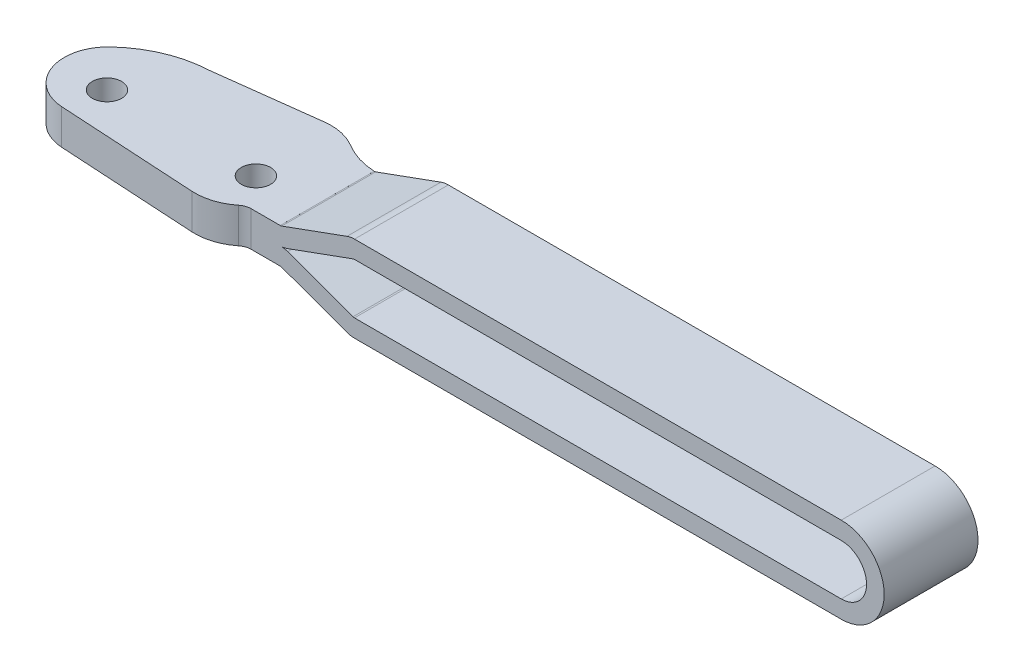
ISO-10303-21;
HEADER;
FILE_DESCRIPTION(('STEP AP214'),'2;1');
FILE_NAME('part.step','',(''),(''),'','','');
FILE_SCHEMA(('AUTOMOTIVE_DESIGN { 1 0 10303 214 1 1 1 1 }'));
ENDSEC;
DATA;
#1=APPLICATION_CONTEXT('core data for automotive mechanical design processes');
#2=APPLICATION_PROTOCOL_DEFINITION('international standard','automotive_design',2000,#1);
#3=PRODUCT_CONTEXT('',#1,'mechanical');
#4=PRODUCT('Part','Part','',(#3));
#5=PRODUCT_RELATED_PRODUCT_CATEGORY('part','',(#4));
#6=PRODUCT_DEFINITION_FORMATION('','',#4);
#7=PRODUCT_DEFINITION_CONTEXT('part definition',#1,'design');
#8=PRODUCT_DEFINITION('design','',#6,#7);
#9=PRODUCT_DEFINITION_SHAPE('','',#8);
#10=(LENGTH_UNIT() NAMED_UNIT(*) SI_UNIT(.MILLI.,.METRE.));
#11=(NAMED_UNIT(*) PLANE_ANGLE_UNIT() SI_UNIT($,.RADIAN.));
#12=(NAMED_UNIT(*) SI_UNIT($,.STERADIAN.) SOLID_ANGLE_UNIT());
#13=UNCERTAINTY_MEASURE_WITH_UNIT(LENGTH_MEASURE(1.E-05),#10,'distance_accuracy_value','');
#14=(GEOMETRIC_REPRESENTATION_CONTEXT(3) GLOBAL_UNCERTAINTY_ASSIGNED_CONTEXT((#13)) GLOBAL_UNIT_ASSIGNED_CONTEXT((#10,
#11,#12)) REPRESENTATION_CONTEXT('',''));
#15=CARTESIAN_POINT('',(0.,0.,0.));
#16=DIRECTION('',(0.,0.,1.));
#17=DIRECTION('',(1.,0.,0.));
#18=AXIS2_PLACEMENT_3D('',#15,#16,#17);
#19=CARTESIAN_POINT('',(47.2063680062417,4.2733725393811,-24.7492));
#20=DIRECTION('',(-0.342020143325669,0.939692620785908,0.));
#21=DIRECTION('',(-0.939692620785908,-0.342020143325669,0.));
#22=AXIS2_PLACEMENT_3D('',#19,#20,#21);
#23=PLANE('',#22);
#24=DIRECTION('',(0.939692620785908,0.342020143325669,0.));
#25=VECTOR('',#24,1.);
#26=CARTESIAN_POINT('',(47.2063680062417,4.27337253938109,5.25080000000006));
#27=LINE('',#26,#25);
#28=CARTESIAN_POINT('',(36.0795709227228,0.223549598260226,5.2508));
#29=VERTEX_POINT('',#28);
#30=CARTESIAN_POINT('',(47.2063680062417,4.2733725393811,5.25080000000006));
#31=VERTEX_POINT('',#30);
#32=EDGE_CURVE('E29',#29,#31,#27,.T.);
#33=ORIENTED_EDGE('',*,*,#32,.F.);
#34=DIRECTION('',(0.,0.,1.));
#35=VECTOR('',#34,1.);
#36=CARTESIAN_POINT('',(36.0795709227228,0.223549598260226,-24.7492));
#37=LINE('',#36,#35);
#38=CARTESIAN_POINT('',(36.0795709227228,0.223549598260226,-10.7512000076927));
#39=VERTEX_POINT('',#38);
#40=EDGE_CURVE('E523',#39,#29,#37,.T.);
#41=ORIENTED_EDGE('',*,*,#40,.F.);
#42=DIRECTION('',(-0.939692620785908,-0.342020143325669,0.));
#43=VECTOR('',#42,1.);
#44=CARTESIAN_POINT('',(47.2063680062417,4.27337253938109,-10.7512000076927));
#45=LINE('',#44,#43);
#46=CARTESIAN_POINT('',(47.2063680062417,4.2733725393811,-10.7512000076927));
#47=VERTEX_POINT('',#46);
#48=EDGE_CURVE('E510',#47,#39,#45,.T.);
#49=ORIENTED_EDGE('',*,*,#48,.F.);
#50=DIRECTION('',(0.,0.,1.));
#51=VECTOR('',#50,1.);
#52=CARTESIAN_POINT('',(47.2063680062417,4.2733725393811,-24.7492));
#53=LINE('',#52,#51);
#54=EDGE_CURVE('E519',#47,#31,#53,.T.);
#55=ORIENTED_EDGE('',*,*,#54,.T.);
#56=EDGE_LOOP('',(#33,#41,#49,#55));
#57=FACE_BOUND('',#56,.T.);
#58=ADVANCED_FACE('F14',(#57),#23,.F.);
#59=CARTESIAN_POINT('',(34.8004155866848,3.73799999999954,-24.7492));
#60=DIRECTION('',(0.,0.,1.));
#61=DIRECTION('',(-1.,0.,0.));
#62=AXIS2_PLACEMENT_3D('',#59,#60,#61);
#63=CYLINDRICAL_SURFACE('',#62,3.74);
#64=CARTESIAN_POINT('',(34.8004155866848,3.73799999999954,5.2508));
#65=DIRECTION('',(0.,0.,1.));
#66=DIRECTION('',(-1.,0.,0.));
#67=AXIS2_PLACEMENT_3D('',#64,#65,#66);
#68=CIRCLE('',#67,3.74);
#69=CARTESIAN_POINT('',(34.922710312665,-1.24032728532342E-13,5.2508));
#70=VERTEX_POINT('',#69);
#71=EDGE_CURVE('E36',#70,#29,#68,.T.);
#72=ORIENTED_EDGE('',*,*,#71,.F.);
#73=DIRECTION('',(0.,0.,1.));
#74=VECTOR('',#73,1.);
#75=CARTESIAN_POINT('',(34.922710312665,-1.24032728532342E-13,-24.7492));
#76=LINE('',#75,#74);
#77=CARTESIAN_POINT('',(34.922710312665,-1.24032728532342E-13,-10.766723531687));
#78=VERTEX_POINT('',#77);
#79=EDGE_CURVE('E525',#78,#70,#76,.T.);
#80=ORIENTED_EDGE('',*,*,#79,.F.);
#81=CARTESIAN_POINT('',(35.8850835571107,0.158740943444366,-10.7512000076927));
#82=CARTESIAN_POINT('',(35.7972347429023,0.132109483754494,-10.7526567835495));
#83=CARTESIAN_POINT('',(35.7084116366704,0.108731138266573,-10.7541134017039));
#84=CARTESIAN_POINT('',(35.5292871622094,0.0685659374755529,-10.7570266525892));
#85=CARTESIAN_POINT('',(35.4389857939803,0.0517790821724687,-10.7584832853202));
#86=CARTESIAN_POINT('',(35.2072776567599,0.0174625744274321,-10.7622006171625));
#87=CARTESIAN_POINT('',(35.0651614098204,0.0046326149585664,-10.7644615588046));
#88=CARTESIAN_POINT('',(34.922710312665,-1.34441069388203E-13,-10.766723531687));
#89=B_SPLINE_CURVE_WITH_KNOTS('',3,(#81,#82,#83,#84,#85,#86,#87,#88),.UNSPECIFIED.,.F.,.F.,(4,2,
2,4),(0.,0.275341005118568,0.550682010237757,0.977929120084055),.UNSPECIFIED.);
#90=CARTESIAN_POINT('',(35.8850835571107,0.158740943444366,-10.7512000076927));
#91=VERTEX_POINT('',#90);
#92=EDGE_CURVE('E9',#91,#78,#89,.T.);
#93=ORIENTED_EDGE('',*,*,#92,.F.);
#94=CARTESIAN_POINT('',(34.8004155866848,3.73799999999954,-10.7512000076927));
#95=DIRECTION('',(0.,0.,-1.));
#96=DIRECTION('',(1.,0.,0.));
#97=AXIS2_PLACEMENT_3D('',#94,#95,#96);
#98=CIRCLE('',#97,3.74);
#99=EDGE_CURVE('E584',#39,#91,#98,.T.);
#100=ORIENTED_EDGE('',*,*,#99,.F.);
#101=ORIENTED_EDGE('',*,*,#40,.T.);
#102=EDGE_LOOP('',(#72,#80,#93,#100,#101));
#103=FACE_BOUND('',#102,.T.);
#104=ADVANCED_FACE('F420',(#103),#63,.T.);
#105=CARTESIAN_POINT('',(34.8004155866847,-3.73799999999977,-24.7492));
#106=DIRECTION('',(0.,0.,1.));
#107=DIRECTION('',(-1.,0.,0.));
#108=AXIS2_PLACEMENT_3D('',#105,#106,#107);
#109=CYLINDRICAL_SURFACE('',#108,3.74);
#110=CARTESIAN_POINT('',(34.8004155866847,-3.73799999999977,5.2508));
#111=DIRECTION('',(0.,0.,1.));
#112=DIRECTION('',(-1.,0.,0.));
#113=AXIS2_PLACEMENT_3D('',#110,#111,#112);
#114=CIRCLE('',#113,3.74);
#115=CARTESIAN_POINT('',(36.0795709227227,-0.223549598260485,5.2508));
#116=VERTEX_POINT('',#115);
#117=EDGE_CURVE('E615',#116,#70,#114,.T.);
#118=ORIENTED_EDGE('',*,*,#117,.F.);
#119=DIRECTION('',(0.,0.,1.));
#120=VECTOR('',#119,1.);
#121=CARTESIAN_POINT('',(36.0795709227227,-0.223549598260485,-24.7492));
#122=LINE('',#121,#120);
#123=CARTESIAN_POINT('',(36.0795709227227,-0.223549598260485,-10.7512000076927));
#124=VERTEX_POINT('',#123);
#125=EDGE_CURVE('E644',#124,#116,#122,.T.);
#126=ORIENTED_EDGE('',*,*,#125,.F.);
#127=CARTESIAN_POINT('',(34.8004155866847,-3.73799999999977,-10.7512000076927));
#128=DIRECTION('',(0.,0.,-1.));
#129=DIRECTION('',(1.,0.,0.));
#130=AXIS2_PLACEMENT_3D('',#127,#128,#129);
#131=CIRCLE('',#130,3.74);
#132=CARTESIAN_POINT('',(35.8850835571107,-0.158740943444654,-10.7512000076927));
#133=VERTEX_POINT('',#132);
#134=EDGE_CURVE('E597',#133,#124,#131,.T.);
#135=ORIENTED_EDGE('',*,*,#134,.F.);
#136=CARTESIAN_POINT('',(34.922710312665,-1.24032728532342E-13,-10.766723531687));
#137=CARTESIAN_POINT('',(35.0144582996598,-0.00299256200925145,-10.7652666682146));
#138=CARTESIAN_POINT('',(35.1060842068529,-0.00937880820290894,-10.7638099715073));
#139=CARTESIAN_POINT('',(35.2886190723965,-0.0288683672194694,-10.7608966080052));
#140=CARTESIAN_POINT('',(35.379528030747,-0.0419716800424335,-10.7594399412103));
#141=CARTESIAN_POINT('',(35.6099826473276,-0.0838877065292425,-10.7557226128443));
#142=CARTESIAN_POINT('',(35.7486908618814,-0.117379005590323,-10.7534617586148));
#143=CARTESIAN_POINT('',(35.8850835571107,-0.158740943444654,-10.7512000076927));
#144=B_SPLINE_CURVE_WITH_KNOTS('',3,(#136,#137,#138,#139,#140,#141,#142,#143),.UNSPECIFIED.,.F.,
.F.,(4,2,2,4),(0.,0.275341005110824,0.550682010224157,0.977929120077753),.UNSPECIFIED.);
#145=EDGE_CURVE('E355',#78,#133,#144,.T.);
#146=ORIENTED_EDGE('',*,*,#145,.F.);
#147=ORIENTED_EDGE('',*,*,#79,.T.);
#148=EDGE_LOOP('',(#118,#126,#135,#146,#147));
#149=FACE_BOUND('',#148,.T.);
#150=ADVANCED_FACE('F424',(#149),#109,.T.);
#151=CARTESIAN_POINT('',(36.0795709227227,-0.223549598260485,-24.7492));
#152=DIRECTION('',(-0.342020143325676,-0.939692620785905,0.));
#153=DIRECTION('',(0.939692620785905,-0.342020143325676,0.));
#154=AXIS2_PLACEMENT_3D('',#151,#152,#153);
#155=PLANE('',#154);
#156=DIRECTION('',(-0.939692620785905,0.342020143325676,0.));
#157=VECTOR('',#156,1.);
#158=CARTESIAN_POINT('',(36.0795709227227,-0.223549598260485,5.2508));
#159=LINE('',#158,#157);
#160=CARTESIAN_POINT('',(47.2063680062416,-4.27337253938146,5.25080000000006));
#161=VERTEX_POINT('',#160);
#162=EDGE_CURVE('E617',#161,#116,#159,.T.);
#163=ORIENTED_EDGE('',*,*,#162,.F.);
#164=DIRECTION('',(0.,0.,1.));
#165=VECTOR('',#164,1.);
#166=CARTESIAN_POINT('',(47.2063680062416,-4.27337253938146,-24.7492));
#167=LINE('',#166,#165);
#168=CARTESIAN_POINT('',(47.2063680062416,-4.27337253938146,-10.7512000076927));
#169=VERTEX_POINT('',#168);
#170=EDGE_CURVE('E641',#169,#161,#167,.T.);
#171=ORIENTED_EDGE('',*,*,#170,.F.);
#172=DIRECTION('',(0.939692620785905,-0.342020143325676,0.));
#173=VECTOR('',#172,1.);
#174=CARTESIAN_POINT('',(36.0795709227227,-0.223549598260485,-10.7512000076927));
#175=LINE('',#174,#173);
#176=EDGE_CURVE('E595',#124,#169,#175,.T.);
#177=ORIENTED_EDGE('',*,*,#176,.F.);
#178=ORIENTED_EDGE('',*,*,#125,.T.);
#179=EDGE_LOOP('',(#163,#171,#177,#178));
#180=FACE_BOUND('',#179,.T.);
#181=ADVANCED_FACE('F429',(#180),#155,.F.);
#182=CARTESIAN_POINT('',(47.4594629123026,-3.57799999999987,-24.7492));
#183=DIRECTION('',(0.,0.,1.));
#184=DIRECTION('',(-1.,0.,0.));
#185=AXIS2_PLACEMENT_3D('',#182,#183,#184);
#186=CYLINDRICAL_SURFACE('',#185,0.740000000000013);
#187=CARTESIAN_POINT('',(47.4594629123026,-3.57799999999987,5.25080000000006));
#188=DIRECTION('',(0.,0.,1.));
#189=DIRECTION('',(-1.,0.,0.));
#190=AXIS2_PLACEMENT_3D('',#187,#188,#189);
#191=CIRCLE('',#190,0.740000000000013);
#192=CARTESIAN_POINT('',(47.4594629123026,-4.31799999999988,5.25080000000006));
#193=VERTEX_POINT('',#192);
#194=EDGE_CURVE('E619',#193,#161,#191,.F.);
#195=ORIENTED_EDGE('',*,*,#194,.F.);
#196=DIRECTION('',(0.,0.,1.));
#197=VECTOR('',#196,1.);
#198=CARTESIAN_POINT('',(47.4594629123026,-4.31799999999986,-24.7492));
#199=LINE('',#198,#197);
#200=CARTESIAN_POINT('',(47.4594629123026,-4.31799999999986,-10.7512000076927));
#201=VERTEX_POINT('',#200);
#202=EDGE_CURVE('E636',#201,#193,#199,.T.);
#203=ORIENTED_EDGE('',*,*,#202,.F.);
#204=CARTESIAN_POINT('',(47.4594629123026,-3.57799999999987,-10.7512000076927));
#205=DIRECTION('',(0.,0.,-1.));
#206=DIRECTION('',(1.,0.,0.));
#207=AXIS2_PLACEMENT_3D('',#204,#205,#206);
#208=CIRCLE('',#207,0.740000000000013);
#209=EDGE_CURVE('E593',#169,#201,#208,.F.);
#210=ORIENTED_EDGE('',*,*,#209,.F.);
#211=ORIENTED_EDGE('',*,*,#170,.T.);
#212=EDGE_LOOP('',(#195,#203,#210,#211));
#213=FACE_BOUND('',#212,.T.);
#214=ADVANCED_FACE('F433',(#213),#186,.F.);
#215=CARTESIAN_POINT('',(47.4594629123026,-4.31799999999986,-24.7492));
#216=DIRECTION('',(0.,-1.,0.));
#217=DIRECTION('',(1.,0.,0.));
#218=AXIS2_PLACEMENT_3D('',#215,#216,#217);
#219=PLANE('',#218);
#220=DIRECTION('',(-1.,0.,0.));
#221=VECTOR('',#220,1.);
#222=CARTESIAN_POINT('',(47.4594629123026,-4.31799999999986,5.25080000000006));
#223=LINE('',#222,#221);
#224=CARTESIAN_POINT('',(130.4574468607,-4.31800000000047,5.25080000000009));
#225=VERTEX_POINT('',#224);
#226=EDGE_CURVE('E621',#225,#193,#223,.T.);
#227=ORIENTED_EDGE('',*,*,#226,.F.);
#228=DIRECTION('',(0.,0.,1.));
#229=VECTOR('',#228,1.);
#230=CARTESIAN_POINT('',(130.4574468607,-4.31800000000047,-24.7492));
#231=LINE('',#230,#229);
#232=CARTESIAN_POINT('',(130.4574468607,-4.31800000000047,-10.7512000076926));
#233=VERTEX_POINT('',#232);
#234=EDGE_CURVE('E633',#233,#225,#231,.T.);
#235=ORIENTED_EDGE('',*,*,#234,.F.);
#236=DIRECTION('',(1.,0.,0.));
#237=VECTOR('',#236,1.);
#238=CARTESIAN_POINT('',(47.4594629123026,-4.31799999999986,-10.7512000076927));
#239=LINE('',#238,#237);
#240=EDGE_CURVE('E591',#201,#233,#239,.T.);
#241=ORIENTED_EDGE('',*,*,#240,.F.);
#242=ORIENTED_EDGE('',*,*,#202,.T.);
#243=EDGE_LOOP('',(#227,#235,#241,#242));
#244=FACE_BOUND('',#243,.T.);
#245=ADVANCED_FACE('F437',(#244),#219,.F.);
#246=CARTESIAN_POINT('',(130.4574468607,-4.64038529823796E-13,-24.7492));
#247=DIRECTION('',(0.,0.,1.));
#248=DIRECTION('',(-1.,0.,0.));
#249=AXIS2_PLACEMENT_3D('',#246,#247,#248);
#250=CYLINDRICAL_SURFACE('',#249,4.318);
#251=CARTESIAN_POINT('',(130.4574468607,-4.64038529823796E-13,5.25080000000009));
#252=DIRECTION('',(0.,0.,1.));
#253=DIRECTION('',(-1.,0.,0.));
#254=AXIS2_PLACEMENT_3D('',#251,#252,#253);
#255=CIRCLE('',#254,4.318);
#256=CARTESIAN_POINT('',(130.4574468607,4.31799999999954,5.25080000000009));
#257=VERTEX_POINT('',#256);
#258=EDGE_CURVE('E623',#257,#225,#255,.F.);
#259=ORIENTED_EDGE('',*,*,#258,.F.);
#260=DIRECTION('',(0.,0.,1.));
#261=VECTOR('',#260,1.);
#262=CARTESIAN_POINT('',(130.4574468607,4.31799999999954,-24.7492));
#263=LINE('',#262,#261);
#264=CARTESIAN_POINT('',(130.4574468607,4.31799999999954,-10.7512000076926));
#265=VERTEX_POINT('',#264);
#266=EDGE_CURVE('E631',#265,#257,#263,.T.);
#267=ORIENTED_EDGE('',*,*,#266,.F.);
#268=CARTESIAN_POINT('',(130.4574468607,-4.64038529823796E-13,-10.7512000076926));
#269=DIRECTION('',(0.,0.,-1.));
#270=DIRECTION('',(1.,0.,0.));
#271=AXIS2_PLACEMENT_3D('',#268,#269,#270);
#272=CIRCLE('',#271,4.318);
#273=EDGE_CURVE('E589',#233,#265,#272,.F.);
#274=ORIENTED_EDGE('',*,*,#273,.F.);
#275=ORIENTED_EDGE('',*,*,#234,.T.);
#276=EDGE_LOOP('',(#259,#267,#274,#275));
#277=FACE_BOUND('',#276,.T.);
#278=ADVANCED_FACE('F441',(#277),#250,.F.);
#279=CARTESIAN_POINT('',(130.4574468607,4.31799999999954,-24.7492));
#280=DIRECTION('',(0.,1.,0.));
#281=DIRECTION('',(0.,0.,1.));
#282=AXIS2_PLACEMENT_3D('',#279,#280,#281);
#283=PLANE('',#282);
#284=DIRECTION('',(1.,0.,0.));
#285=VECTOR('',#284,1.);
#286=CARTESIAN_POINT('',(130.4574468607,4.31799999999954,5.25080000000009));
#287=LINE('',#286,#285);
#288=CARTESIAN_POINT('',(47.4594629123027,4.31799999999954,5.25080000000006));
#289=VERTEX_POINT('',#288);
#290=EDGE_CURVE('E521',#289,#257,#287,.T.);
#291=ORIENTED_EDGE('',*,*,#290,.F.);
#292=DIRECTION('',(0.,0.,1.));
#293=VECTOR('',#292,1.);
#294=CARTESIAN_POINT('',(47.4594629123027,4.31799999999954,-24.7492));
#295=LINE('',#294,#293);
#296=CARTESIAN_POINT('',(47.4594629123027,4.31799999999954,-10.7512000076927));
#297=VERTEX_POINT('',#296);
#298=EDGE_CURVE('E506',#297,#289,#295,.T.);
#299=ORIENTED_EDGE('',*,*,#298,.F.);
#300=DIRECTION('',(-1.,0.,0.));
#301=VECTOR('',#300,1.);
#302=CARTESIAN_POINT('',(130.4574468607,4.31799999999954,-10.7512000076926));
#303=LINE('',#302,#301);
#304=EDGE_CURVE('E587',#265,#297,#303,.T.);
#305=ORIENTED_EDGE('',*,*,#304,.F.);
#306=ORIENTED_EDGE('',*,*,#266,.T.);
#307=EDGE_LOOP('',(#291,#299,#305,#306));
#308=FACE_BOUND('',#307,.T.);
#309=ADVANCED_FACE('F417',(#308),#283,.F.);
#310=CARTESIAN_POINT('',(47.4594629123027,3.57799999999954,-24.7492));
#311=DIRECTION('',(0.,0.,1.));
#312=DIRECTION('',(-1.,0.,0.));
#313=AXIS2_PLACEMENT_3D('',#310,#311,#312);
#314=CYLINDRICAL_SURFACE('',#313,0.74);
#315=CARTESIAN_POINT('',(47.4594629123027,3.57799999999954,5.25080000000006));
#316=DIRECTION('',(0.,0.,1.));
#317=DIRECTION('',(-1.,0.,0.));
#318=AXIS2_PLACEMENT_3D('',#315,#316,#317);
#319=CIRCLE('',#318,0.74);
#320=EDGE_CURVE('E492',#31,#289,#319,.F.);
#321=ORIENTED_EDGE('',*,*,#320,.F.);
#322=ORIENTED_EDGE('',*,*,#54,.F.);
#323=CARTESIAN_POINT('',(47.4594629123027,3.57799999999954,-10.7512000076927));
#324=DIRECTION('',(0.,0.,-1.));
#325=DIRECTION('',(1.,0.,0.));
#326=AXIS2_PLACEMENT_3D('',#323,#324,#325);
#327=CIRCLE('',#326,0.74);
#328=EDGE_CURVE('E44',#297,#47,#327,.F.);
#329=ORIENTED_EDGE('',*,*,#328,.F.);
#330=ORIENTED_EDGE('',*,*,#298,.T.);
#331=EDGE_LOOP('',(#321,#322,#329,#330));
#332=FACE_BOUND('',#331,.T.);
#333=ADVANCED_FACE('F334',(#332),#314,.F.);
#334=CARTESIAN_POINT('',(34.8004155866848,32.0019999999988,-10.7686647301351));
#335=CARTESIAN_POINT('',(35.1672420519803,32.0019999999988,-10.7628431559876));
#336=CARTESIAN_POINT('',(35.5340228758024,32.0019999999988,-10.7570215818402));
#337=CARTESIAN_POINT('',(35.8850835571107,32.0019999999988,-10.7512000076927));
#338=B_SPLINE_CURVE_WITH_KNOTS('',3,(#334,#335,#336,#337),.UNSPECIFIED.,.F.,.F.,(4,4),(0.,1.),.UNSPECIFIED.);
#339=DIRECTION('',(0.,-1.,0.));
#340=VECTOR('',#339,1.);
#341=SURFACE_OF_LINEAR_EXTRUSION('',#338,#340);
#342=CARTESIAN_POINT('',(35.8850835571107,3.34529530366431,-10.7512000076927));
#343=CARTESIAN_POINT('',(35.7464887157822,3.29485090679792,-10.7534871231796));
#344=CARTESIAN_POINT('',(35.6078935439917,3.2444063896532,-10.7557510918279));
#345=CARTESIAN_POINT('',(35.3307025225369,3.14351710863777,-10.7602327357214));
#346=CARTESIAN_POINT('',(35.1921066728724,3.09307234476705,-10.7624504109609));
#347=CARTESIAN_POINT('',(35.0535104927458,3.04262746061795,-10.7646449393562));
#348=B_SPLINE_CURVE_WITH_KNOTS('',3,(#342,#343,#344,#345,#346,#347),.UNSPECIFIED.,.F.,.F.,(4,2,
4),(0.,0.442521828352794,0.885043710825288),.UNSPECIFIED.);
#349=CARTESIAN_POINT('',(35.8850835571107,3.34529530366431,-10.7512000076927));
#350=VERTEX_POINT('',#349);
#351=CARTESIAN_POINT('',(35.0535104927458,3.04262746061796,-10.7646449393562));
#352=VERTEX_POINT('',#351);
#353=EDGE_CURVE('E375',#350,#352,#348,.T.);
#354=ORIENTED_EDGE('',*,*,#353,.F.);
#355=DIRECTION('',(0.,-1.,0.));
#356=VECTOR('',#355,1.);
#357=CARTESIAN_POINT('',(35.8850835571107,32.0019999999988,-10.7512000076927));
#358=LINE('',#357,#356);
#359=EDGE_CURVE('E234',#350,#91,#358,.T.);
#360=ORIENTED_EDGE('',*,*,#359,.T.);
#361=ORIENTED_EDGE('',*,*,#92,.T.);
#362=ORIENTED_EDGE('',*,*,#145,.T.);
#363=CARTESIAN_POINT('',(35.8850835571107,-3.34529530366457,-10.7512000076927));
#364=VERTEX_POINT('',#363);
#365=EDGE_CURVE('E573',#133,#364,#358,.T.);
#366=ORIENTED_EDGE('',*,*,#365,.T.);
#367=CARTESIAN_POINT('',(35.0535104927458,-3.0426274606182,-10.7646449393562));
#368=CARTESIAN_POINT('',(35.1921066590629,-3.09307233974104,-10.7624504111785));
#369=CARTESIAN_POINT('',(35.3307024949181,-3.14351709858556,-10.7602327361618));
#370=CARTESIAN_POINT('',(35.6078935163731,-3.24440637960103,-10.7557510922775));
#371=CARTESIAN_POINT('',(35.7464887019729,-3.29485090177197,-10.7534871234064));
#372=CARTESIAN_POINT('',(35.8850835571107,-3.34529530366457,-10.7512000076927));
#373=B_SPLINE_CURVE_WITH_KNOTS('',3,(#367,#368,#369,#370,#371,#372),.UNSPECIFIED.,.F.,.F.,(4,2,
4),(0.,0.442521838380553,0.885043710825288),.UNSPECIFIED.);
#374=CARTESIAN_POINT('',(35.0535104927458,-3.04262746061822,-10.7646449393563));
#375=VERTEX_POINT('',#374);
#376=EDGE_CURVE('E369',#375,#364,#373,.T.);
#377=ORIENTED_EDGE('',*,*,#376,.F.);
#378=CARTESIAN_POINT('',(34.8004155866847,-2.99799999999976,-10.7686647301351));
#379=CARTESIAN_POINT('',(34.8148467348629,-2.99799948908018,-10.7684357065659));
#380=CARTESIAN_POINT('',(34.829277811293,-2.99842212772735,-10.7682066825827));
#381=CARTESIAN_POINT('',(34.8579939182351,-3.00010433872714,-10.767750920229));
#382=CARTESIAN_POINT('',(34.8722792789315,-3.00135827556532,-10.7675241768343));
#383=CARTESIAN_POINT('',(34.9007050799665,-3.00468822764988,-10.767072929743));
#384=CARTESIAN_POINT('',(34.9148458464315,-3.00676145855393,-10.7668484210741));
#385=CARTESIAN_POINT('',(34.9429837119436,-3.01172290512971,-10.7664015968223));
#386=CARTESIAN_POINT('',(34.9569808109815,-3.0146111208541,-10.7661792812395));
#387=CARTESIAN_POINT('',(34.9848313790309,-3.02120418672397,-10.7657368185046));
#388=CARTESIAN_POINT('',(34.9986842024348,-3.02491176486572,-10.7655166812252));
#389=CARTESIAN_POINT('',(35.026244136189,-3.03315255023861,-10.7650785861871));
#390=CARTESIAN_POINT('',(35.0399496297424,-3.03769116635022,-10.7648606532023));
#391=CARTESIAN_POINT('',(35.0535104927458,-3.04262746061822,-10.7646449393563));
#392=B_SPLINE_CURVE_WITH_KNOTS('',3,(#378,#379,#380,#381,#382,#383,#384,#385,#386,#387,#388,
#389,#390,#391),.UNSPECIFIED.,.F.,.F.,(4,2,2,2,2,2,4),(0.,0.0432925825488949,0.0862946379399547,
0.129151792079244,0.172008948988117,0.215011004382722,0.258303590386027),.UNSPECIFIED.);
#393=CARTESIAN_POINT('',(34.8004155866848,-2.99799999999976,-10.7686647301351));
#394=VERTEX_POINT('',#393);
#395=EDGE_CURVE('E363',#394,#375,#392,.T.);
#396=ORIENTED_EDGE('',*,*,#395,.F.);
#397=DIRECTION('',(0.,-1.,0.));
#398=VECTOR('',#397,1.);
#399=CARTESIAN_POINT('',(34.8004155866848,32.0019999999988,-10.7686647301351));
#400=LINE('',#399,#398);
#401=CARTESIAN_POINT('',(34.8004155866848,2.99799999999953,-10.7686647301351));
#402=VERTEX_POINT('',#401);
#403=EDGE_CURVE('E469',#402,#394,#400,.T.);
#404=ORIENTED_EDGE('',*,*,#403,.F.);
#405=CARTESIAN_POINT('',(35.0535104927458,3.04262746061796,-10.7646449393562));
#406=CARTESIAN_POINT('',(35.0399496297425,3.03769116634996,-10.7648606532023));
#407=CARTESIAN_POINT('',(35.026244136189,3.03315255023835,-10.7650785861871));
#408=CARTESIAN_POINT('',(34.9986842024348,3.02491176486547,-10.7655166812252));
#409=CARTESIAN_POINT('',(34.9848313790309,3.02120418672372,-10.7657368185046));
#410=CARTESIAN_POINT('',(34.9569808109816,3.01461112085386,-10.7661792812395));
#411=CARTESIAN_POINT('',(34.9429837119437,3.01172290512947,-10.7664015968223));
#412=CARTESIAN_POINT('',(34.9148458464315,3.00676145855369,-10.7668484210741));
#413=CARTESIAN_POINT('',(34.9007050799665,3.00468822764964,-10.767072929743));
#414=CARTESIAN_POINT('',(34.8722792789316,3.00135827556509,-10.7675241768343));
#415=CARTESIAN_POINT('',(34.8579939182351,3.00010433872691,-10.767750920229));
#416=CARTESIAN_POINT('',(34.8292778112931,2.99842212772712,-10.7682066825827));
#417=CARTESIAN_POINT('',(34.814846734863,2.99799948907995,-10.7684357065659));
#418=CARTESIAN_POINT('',(34.8004155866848,2.99799999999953,-10.7686647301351));
#419=B_SPLINE_CURVE_WITH_KNOTS('',3,(#405,#406,#407,#408,#409,#410,#411,#412,#413,#414,#415,
#416,#417,#418),.UNSPECIFIED.,.F.,.F.,(4,2,2,2,2,2,4),(0.,0.0432925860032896,0.0862946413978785,
0.12915179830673,0.172008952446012,0.21501100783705,0.258303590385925),.UNSPECIFIED.);
#420=EDGE_CURVE('E343',#352,#402,#419,.T.);
#421=ORIENTED_EDGE('',*,*,#420,.F.);
#422=EDGE_LOOP('',(#354,#360,#361,#362,#366,#377,#396,#404,#421));
#423=FACE_BOUND('',#422,.T.);
#424=ADVANCED_FACE('F329',(#423),#341,.T.);
#425=CARTESIAN_POINT('',(137.7754468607,32.0019999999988,5.25080000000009));
#426=DIRECTION('',(0.,0.,1.));
#427=DIRECTION('',(-1.,0.,0.));
#428=AXIS2_PLACEMENT_3D('',#425,#426,#427);
#429=PLANE('',#428);
#430=DIRECTION('',(0.,-1.,0.));
#431=VECTOR('',#430,1.);
#432=CARTESIAN_POINT('',(29.8413398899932,32.0019999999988,5.2508));
#433=LINE('',#432,#431);
#434=CARTESIAN_POINT('',(29.8413398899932,2.99999999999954,5.2508));
#435=VERTEX_POINT('',#434);
#436=CARTESIAN_POINT('',(29.8413398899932,-2.99999999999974,5.2508));
#437=VERTEX_POINT('',#436);
#438=EDGE_CURVE('E223',#435,#437,#433,.T.);
#439=ORIENTED_EDGE('',*,*,#438,.T.);
#440=DIRECTION('',(-1.,0.,0.));
#441=VECTOR('',#440,1.);
#442=CARTESIAN_POINT('',(34.8004155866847,-2.99999999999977,5.2508));
#443=LINE('',#442,#441);
#444=CARTESIAN_POINT('',(34.8004155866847,-2.99999999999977,5.2508));
#445=VERTEX_POINT('',#444);
#446=EDGE_CURVE('E292',#445,#437,#443,.T.);
#447=ORIENTED_EDGE('',*,*,#446,.F.);
#448=DIRECTION('',(0.,1.,0.));
#449=VECTOR('',#448,1.);
#450=CARTESIAN_POINT('',(34.8004155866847,-2.99999999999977,5.2508));
#451=LINE('',#450,#449);
#452=CARTESIAN_POINT('',(34.8004155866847,-2.99799999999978,5.2508));
#453=VERTEX_POINT('',#452);
#454=EDGE_CURVE('E313',#445,#453,#451,.T.);
#455=ORIENTED_EDGE('',*,*,#454,.T.);
#456=CARTESIAN_POINT('',(34.8004155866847,-3.73799999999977,5.2508));
#457=DIRECTION('',(0.,0.,1.));
#458=DIRECTION('',(-1.,0.,0.));
#459=AXIS2_PLACEMENT_3D('',#456,#457,#458);
#460=CIRCLE('',#459,0.74);
#461=CARTESIAN_POINT('',(35.0535104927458,-3.04262746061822,5.2508));
#462=VERTEX_POINT('',#461);
#463=EDGE_CURVE('E486',#462,#453,#460,.T.);
#464=ORIENTED_EDGE('',*,*,#463,.F.);
#465=DIRECTION('',(-0.939692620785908,0.342020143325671,0.));
#466=VECTOR('',#465,1.);
#467=CARTESIAN_POINT('',(35.0535104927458,-3.0426274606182,5.2508));
#468=LINE('',#467,#466);
#469=CARTESIAN_POINT('',(46.1803075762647,-7.09245040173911,5.25080000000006));
#470=VERTEX_POINT('',#469);
#471=EDGE_CURVE('E488',#470,#462,#468,.T.);
#472=ORIENTED_EDGE('',*,*,#471,.F.);
#473=CARTESIAN_POINT('',(47.4594629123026,-3.57799999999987,5.25080000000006));
#474=DIRECTION('',(0.,0.,1.));
#475=DIRECTION('',(-1.,0.,0.));
#476=AXIS2_PLACEMENT_3D('',#473,#474,#475);
#477=CIRCLE('',#476,3.73999999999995);
#478=CARTESIAN_POINT('',(47.4594629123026,-7.31799999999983,5.25080000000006));
#479=VERTEX_POINT('',#478);
#480=EDGE_CURVE('E500',#479,#470,#477,.F.);
#481=ORIENTED_EDGE('',*,*,#480,.F.);
#482=DIRECTION('',(-1.,0.,0.));
#483=VECTOR('',#482,1.);
#484=CARTESIAN_POINT('',(47.4594629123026,-7.31799999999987,5.25080000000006));
#485=LINE('',#484,#483);
#486=CARTESIAN_POINT('',(130.4574468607,-7.31800000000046,5.25080000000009));
#487=VERTEX_POINT('',#486);
#488=EDGE_CURVE('E555',#487,#479,#485,.T.);
#489=ORIENTED_EDGE('',*,*,#488,.F.);
#490=CARTESIAN_POINT('',(130.4574468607,-4.64038529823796E-13,5.25080000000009));
#491=DIRECTION('',(0.,0.,1.));
#492=DIRECTION('',(-1.,0.,0.));
#493=AXIS2_PLACEMENT_3D('',#490,#491,#492);
#494=CIRCLE('',#493,7.318);
#495=CARTESIAN_POINT('',(130.4574468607,7.31799999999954,5.25080000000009));
#496=VERTEX_POINT('',#495);
#497=EDGE_CURVE('E556',#496,#487,#494,.F.);
#498=ORIENTED_EDGE('',*,*,#497,.F.);
#499=DIRECTION('',(1.,0.,0.));
#500=VECTOR('',#499,1.);
#501=CARTESIAN_POINT('',(130.4574468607,7.31799999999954,5.25080000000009));
#502=LINE('',#501,#500);
#503=CARTESIAN_POINT('',(47.4594629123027,7.31799999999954,5.25080000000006));
#504=VERTEX_POINT('',#503);
#505=EDGE_CURVE('E558',#504,#496,#502,.T.);
#506=ORIENTED_EDGE('',*,*,#505,.F.);
#507=CARTESIAN_POINT('',(47.4594629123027,3.57799999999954,5.25080000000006));
#508=DIRECTION('',(0.,0.,1.));
#509=DIRECTION('',(-1.,0.,0.));
#510=AXIS2_PLACEMENT_3D('',#507,#508,#509);
#511=CIRCLE('',#510,3.74);
#512=CARTESIAN_POINT('',(46.1803075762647,7.09245040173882,5.25080000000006));
#513=VERTEX_POINT('',#512);
#514=EDGE_CURVE('E564',#513,#504,#511,.F.);
#515=ORIENTED_EDGE('',*,*,#514,.F.);
#516=DIRECTION('',(0.939692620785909,0.342020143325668,0.));
#517=VECTOR('',#516,1.);
#518=CARTESIAN_POINT('',(46.1803075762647,7.09245040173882,5.2508));
#519=LINE('',#518,#517);
#520=CARTESIAN_POINT('',(35.0535104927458,3.04262746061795,5.2508));
#521=VERTEX_POINT('',#520);
#522=EDGE_CURVE('E567',#521,#513,#519,.T.);
#523=ORIENTED_EDGE('',*,*,#522,.F.);
#524=CARTESIAN_POINT('',(34.8004155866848,3.73799999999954,5.2508));
#525=DIRECTION('',(0.,0.,1.));
#526=DIRECTION('',(-1.,0.,0.));
#527=AXIS2_PLACEMENT_3D('',#524,#525,#526);
#528=CIRCLE('',#527,0.74);
#529=CARTESIAN_POINT('',(34.8004155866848,2.99799999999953,5.2508));
#530=VERTEX_POINT('',#529);
#531=EDGE_CURVE('E570',#530,#521,#528,.T.);
#532=ORIENTED_EDGE('',*,*,#531,.F.);
#533=DIRECTION('',(0.,-1.,0.));
#534=VECTOR('',#533,1.);
#535=CARTESIAN_POINT('',(34.8004155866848,2.99999999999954,5.2508));
#536=LINE('',#535,#534);
#537=CARTESIAN_POINT('',(34.8004155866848,2.99999999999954,5.2508));
#538=VERTEX_POINT('',#537);
#539=EDGE_CURVE('E240',#538,#530,#536,.T.);
#540=ORIENTED_EDGE('',*,*,#539,.F.);
#541=DIRECTION('',(1.,0.,0.));
#542=VECTOR('',#541,1.);
#543=CARTESIAN_POINT('',(29.8413398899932,2.99999999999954,5.2508));
#544=LINE('',#543,#542);
#545=EDGE_CURVE('E237',#435,#538,#544,.T.);
#546=ORIENTED_EDGE('',*,*,#545,.F.);
#547=EDGE_LOOP('',(#439,#447,#455,#464,#472,#481,#489,#498,#506,#515,#523,#532,#540,#546));
#548=FACE_BOUND('',#547,.T.);
#549=ORIENTED_EDGE('',*,*,#320,.T.);
#550=ORIENTED_EDGE('',*,*,#290,.T.);
#551=ORIENTED_EDGE('',*,*,#258,.T.);
#552=ORIENTED_EDGE('',*,*,#226,.T.);
#553=ORIENTED_EDGE('',*,*,#194,.T.);
#554=ORIENTED_EDGE('',*,*,#162,.T.);
#555=ORIENTED_EDGE('',*,*,#117,.T.);
#556=ORIENTED_EDGE('',*,*,#71,.T.);
#557=ORIENTED_EDGE('',*,*,#32,.T.);
#558=EDGE_LOOP('',(#549,#550,#551,#552,#553,#554,#555,#556,#557));
#559=FACE_BOUND('',#558,.T.);
#560=ADVANCED_FACE('F238',(#548,#559),#429,.T.);
#561=CARTESIAN_POINT('',(137.7754468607,32.0019999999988,-10.7512000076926));
#562=DIRECTION('',(0.,0.,-1.));
#563=DIRECTION('',(1.,0.,0.));
#564=AXIS2_PLACEMENT_3D('',#561,#562,#563);
#565=PLANE('',#564);
#566=CARTESIAN_POINT('',(47.4594629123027,3.57799999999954,-10.7512000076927));
#567=DIRECTION('',(0.,0.,-1.));
#568=DIRECTION('',(1.,0.,0.));
#569=AXIS2_PLACEMENT_3D('',#566,#567,#568);
#570=CIRCLE('',#569,3.74);
#571=CARTESIAN_POINT('',(47.4594629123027,7.31799999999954,-10.7512000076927));
#572=VERTEX_POINT('',#571);
#573=CARTESIAN_POINT('',(46.1803075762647,7.09245040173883,-10.7512000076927));
#574=VERTEX_POINT('',#573);
#575=EDGE_CURVE('E608',#572,#574,#570,.F.);
#576=ORIENTED_EDGE('',*,*,#575,.F.);
#577=DIRECTION('',(-1.,0.,0.));
#578=VECTOR('',#577,1.);
#579=CARTESIAN_POINT('',(130.4574468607,7.31799999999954,-10.7512000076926));
#580=LINE('',#579,#578);
#581=CARTESIAN_POINT('',(130.4574468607,7.31799999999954,-10.7512000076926));
#582=VERTEX_POINT('',#581);
#583=EDGE_CURVE('E605',#582,#572,#580,.T.);
#584=ORIENTED_EDGE('',*,*,#583,.F.);
#585=CARTESIAN_POINT('',(130.4574468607,-4.64038529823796E-13,-10.7512000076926));
#586=DIRECTION('',(0.,0.,-1.));
#587=DIRECTION('',(1.,0.,0.));
#588=AXIS2_PLACEMENT_3D('',#585,#586,#587);
#589=CIRCLE('',#588,7.318);
#590=CARTESIAN_POINT('',(130.4574468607,-7.31800000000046,-10.7512000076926));
#591=VERTEX_POINT('',#590);
#592=EDGE_CURVE('E603',#591,#582,#589,.F.);
#593=ORIENTED_EDGE('',*,*,#592,.F.);
#594=DIRECTION('',(1.,0.,0.));
#595=VECTOR('',#594,1.);
#596=CARTESIAN_POINT('',(47.4594629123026,-7.31799999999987,-10.7512000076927));
#597=LINE('',#596,#595);
#598=CARTESIAN_POINT('',(47.4594629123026,-7.31799999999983,-10.7512000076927));
#599=VERTEX_POINT('',#598);
#600=EDGE_CURVE('E552',#599,#591,#597,.T.);
#601=ORIENTED_EDGE('',*,*,#600,.F.);
#602=CARTESIAN_POINT('',(47.4594629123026,-3.57799999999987,-10.7512000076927));
#603=DIRECTION('',(0.,0.,-1.));
#604=DIRECTION('',(1.,0.,0.));
#605=AXIS2_PLACEMENT_3D('',#602,#603,#604);
#606=CIRCLE('',#605,3.73999999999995);
#607=CARTESIAN_POINT('',(46.1803075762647,-7.09245040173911,-10.7512000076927));
#608=VERTEX_POINT('',#607);
#609=EDGE_CURVE('E549',#608,#599,#606,.F.);
#610=ORIENTED_EDGE('',*,*,#609,.F.);
#611=DIRECTION('',(0.939692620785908,-0.342020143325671,0.));
#612=VECTOR('',#611,1.);
#613=CARTESIAN_POINT('',(35.0535104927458,-3.0426274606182,-10.7512000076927));
#614=LINE('',#613,#612);
#615=EDGE_CURVE('E599',#364,#608,#614,.T.);
#616=ORIENTED_EDGE('',*,*,#615,.F.);
#617=ORIENTED_EDGE('',*,*,#365,.F.);
#618=ORIENTED_EDGE('',*,*,#134,.T.);
#619=ORIENTED_EDGE('',*,*,#176,.T.);
#620=ORIENTED_EDGE('',*,*,#209,.T.);
#621=ORIENTED_EDGE('',*,*,#240,.T.);
#622=ORIENTED_EDGE('',*,*,#273,.T.);
#623=ORIENTED_EDGE('',*,*,#304,.T.);
#624=ORIENTED_EDGE('',*,*,#328,.T.);
#625=ORIENTED_EDGE('',*,*,#48,.T.);
#626=ORIENTED_EDGE('',*,*,#99,.T.);
#627=ORIENTED_EDGE('',*,*,#359,.F.);
#628=DIRECTION('',(-0.939692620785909,-0.342020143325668,0.));
#629=VECTOR('',#628,1.);
#630=CARTESIAN_POINT('',(46.1803075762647,7.09245040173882,-10.7512000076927));
#631=LINE('',#630,#629);
#632=EDGE_CURVE('E611',#574,#350,#631,.T.);
#633=ORIENTED_EDGE('',*,*,#632,.F.);
#634=EDGE_LOOP('',(#576,#584,#593,#601,#610,#616,#617,#618,#619,#620,#621,#622,#623,#624,#625,
#626,#627,#633));
#635=FACE_BOUND('',#634,.T.);
#636=ADVANCED_FACE('F336',(#635),#565,.T.);
#637=CARTESIAN_POINT('',(6.61093572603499,32.0019999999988,6.92432278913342));
#638=DIRECTION('',(0.,-1.,0.));
#639=DIRECTION('',(1.,0.,0.));
#640=AXIS2_PLACEMENT_3D('',#637,#638,#639);
#641=CYLINDRICAL_SURFACE('',#640,18.5549228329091);
#642=DIRECTION('',(0.,-1.,0.));
#643=VECTOR('',#642,1.);
#644=CARTESIAN_POINT('',(5.8376980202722,32.0019999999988,-11.6144815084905));
#645=LINE('',#644,#643);
#646=CARTESIAN_POINT('',(5.8376980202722,2.99999999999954,-11.6144815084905));
#647=VERTEX_POINT('',#646);
#648=CARTESIAN_POINT('',(5.8376980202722,-2.99999999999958,-11.6144815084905));
#649=VERTEX_POINT('',#648);
#650=EDGE_CURVE('E319',#647,#649,#645,.T.);
#651=ORIENTED_EDGE('',*,*,#650,.T.);
#652=CARTESIAN_POINT('',(6.61093572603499,-2.99999999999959,6.92432278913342));
#653=DIRECTION('',(0.,-1.,0.));
#654=DIRECTION('',(1.,0.,0.));
#655=AXIS2_PLACEMENT_3D('',#652,#653,#654);
#656=CIRCLE('',#655,18.5549228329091);
#657=CARTESIAN_POINT('',(-6.06278726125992,-2.9999999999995,-6.62786917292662));
#658=VERTEX_POINT('',#657);
#659=EDGE_CURVE('E304',#658,#649,#656,.T.);
#660=ORIENTED_EDGE('',*,*,#659,.F.);
#661=DIRECTION('',(0.,-1.,0.));
#662=VECTOR('',#661,1.);
#663=CARTESIAN_POINT('',(-6.0627872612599,32.0019999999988,-6.62786917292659));
#664=LINE('',#663,#662);
#665=CARTESIAN_POINT('',(-6.06278726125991,2.99999999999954,-6.62786917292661));
#666=VERTEX_POINT('',#665);
#667=EDGE_CURVE('E324',#666,#658,#664,.T.);
#668=ORIENTED_EDGE('',*,*,#667,.F.);
#669=CARTESIAN_POINT('',(6.61093572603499,2.99999999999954,6.92432278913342));
#670=DIRECTION('',(0.,1.,0.));
#671=DIRECTION('',(0.,0.,1.));
#672=AXIS2_PLACEMENT_3D('',#669,#670,#671);
#673=CIRCLE('',#672,18.5549228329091);
#674=EDGE_CURVE('E268',#647,#666,#673,.T.);
#675=ORIENTED_EDGE('',*,*,#674,.F.);
#676=EDGE_LOOP('',(#651,#660,#668,#675));
#677=FACE_BOUND('',#676,.T.);
#678=ADVANCED_FACE('F449',(#677),#641,.T.);
#679=CARTESIAN_POINT('',(-0.9399999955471,32.0019999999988,-1.15000000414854));
#680=DIRECTION('',(0.,-1.,0.));
#681=DIRECTION('',(1.,0.,0.));
#682=AXIS2_PLACEMENT_3D('',#679,#680,#681);
#683=CYLINDRICAL_SURFACE('',#682,7.49999999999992);
#684=ORIENTED_EDGE('',*,*,#667,.T.);
#685=CARTESIAN_POINT('',(-0.9399999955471,-2.99999999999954,-1.15000000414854));
#686=DIRECTION('',(0.,-1.,0.));
#687=DIRECTION('',(1.,0.,0.));
#688=AXIS2_PLACEMENT_3D('',#685,#686,#687);
#689=CIRCLE('',#688,7.5);
#690=CARTESIAN_POINT('',(-1.38060858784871,-2.99999999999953,6.33704641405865));
#691=VERTEX_POINT('',#690);
#692=EDGE_CURVE('E301',#691,#658,#689,.T.);
#693=ORIENTED_EDGE('',*,*,#692,.F.);
#694=DIRECTION('',(0.,-1.,0.));
#695=VECTOR('',#694,1.);
#696=CARTESIAN_POINT('',(-1.38060858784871,32.0019999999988,6.33704641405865));
#697=LINE('',#696,#695);
#698=CARTESIAN_POINT('',(-1.38060858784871,2.99999999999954,6.33704641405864));
#699=VERTEX_POINT('',#698);
#700=EDGE_CURVE('E679',#699,#691,#697,.T.);
#701=ORIENTED_EDGE('',*,*,#700,.F.);
#702=CARTESIAN_POINT('',(-0.9399999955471,2.99999999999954,-1.15000000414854));
#703=DIRECTION('',(0.,1.,0.));
#704=DIRECTION('',(0.,0.,1.));
#705=AXIS2_PLACEMENT_3D('',#702,#703,#704);
#706=CIRCLE('',#705,7.5);
#707=EDGE_CURVE('E271',#666,#699,#706,.T.);
#708=ORIENTED_EDGE('',*,*,#707,.F.);
#709=EDGE_LOOP('',(#684,#693,#701,#708));
#710=FACE_BOUND('',#709,.T.);
#711=ADVANCED_FACE('F452',(#710),#683,.T.);
#712=CARTESIAN_POINT('',(-1.38060858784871,32.0019999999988,6.33704641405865));
#713=DIRECTION('',(-0.0587478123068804,0.,0.998272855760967));
#714=DIRECTION('',(-0.998272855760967,0.,-0.0587478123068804));
#715=AXIS2_PLACEMENT_3D('',#712,#713,#714);
#716=PLANE('',#715);
#717=ORIENTED_EDGE('',*,*,#700,.T.);
#718=DIRECTION('',(-0.998272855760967,0.,-0.0587478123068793));
#719=VECTOR('',#718,1.);
#720=CARTESIAN_POINT('',(22.1981874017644,-2.99999999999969,7.72464567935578));
#721=LINE('',#720,#719);
#722=CARTESIAN_POINT('',(22.1981874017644,-2.99999999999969,7.72464567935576));
#723=VERTEX_POINT('',#722);
#724=EDGE_CURVE('E298',#723,#691,#721,.T.);
#725=ORIENTED_EDGE('',*,*,#724,.F.);
#726=DIRECTION('',(0.,-1.,0.));
#727=VECTOR('',#726,1.);
#728=CARTESIAN_POINT('',(22.1981874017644,32.0019999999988,7.72464567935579));
#729=LINE('',#728,#727);
#730=CARTESIAN_POINT('',(22.1981874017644,2.99999999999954,7.72464567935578));
#731=VERTEX_POINT('',#730);
#732=EDGE_CURVE('E678',#731,#723,#729,.T.);
#733=ORIENTED_EDGE('',*,*,#732,.F.);
#734=DIRECTION('',(0.998272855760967,0.,0.0587478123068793));
#735=VECTOR('',#734,1.);
#736=CARTESIAN_POINT('',(-1.38060858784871,2.99999999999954,6.33704641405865));
#737=LINE('',#736,#735);
#738=EDGE_CURVE('E274',#699,#731,#737,.T.);
#739=ORIENTED_EDGE('',*,*,#738,.F.);
#740=EDGE_LOOP('',(#717,#725,#733,#739));
#741=FACE_BOUND('',#740,.T.);
#742=ADVANCED_FACE('F686',(#741),#716,.T.);
#743=CARTESIAN_POINT('',(22.7204554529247,32.0019999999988,-1.15000000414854));
#744=DIRECTION('',(0.,-1.,0.));
#745=DIRECTION('',(1.,0.,0.));
#746=AXIS2_PLACEMENT_3D('',#743,#744,#745);
#747=CYLINDRICAL_SURFACE('',#746,8.88999999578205);
#748=ORIENTED_EDGE('',*,*,#732,.T.);
#749=CARTESIAN_POINT('',(22.7204554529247,-2.9999999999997,-1.15000000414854));
#750=DIRECTION('',(0.,-1.,0.));
#751=DIRECTION('',(1.,0.,0.));
#752=AXIS2_PLACEMENT_3D('',#749,#750,#751);
#753=CIRCLE('',#752,8.88999999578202);
#754=CARTESIAN_POINT('',(28.2589211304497,-2.99999999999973,5.80395555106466));
#755=VERTEX_POINT('',#754);
#756=EDGE_CURVE('E295',#755,#723,#753,.T.);
#757=ORIENTED_EDGE('',*,*,#756,.F.);
#758=DIRECTION('',(0.,-1.,0.));
#759=VECTOR('',#758,1.);
#760=CARTESIAN_POINT('',(28.2589211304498,32.0019999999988,5.80395555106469));
#761=LINE('',#760,#759);
#762=CARTESIAN_POINT('',(28.2589211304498,2.99999999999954,5.80395555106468));
#763=VERTEX_POINT('',#762);
#764=EDGE_CURVE('E233',#763,#755,#761,.T.);
#765=ORIENTED_EDGE('',*,*,#764,.F.);
#766=CARTESIAN_POINT('',(22.7204554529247,2.99999999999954,-1.15000000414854));
#767=DIRECTION('',(0.,1.,0.));
#768=DIRECTION('',(0.,0.,1.));
#769=AXIS2_PLACEMENT_3D('',#766,#767,#768);
#770=CIRCLE('',#769,8.88999999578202);
#771=EDGE_CURVE('E250',#731,#763,#770,.T.);
#772=ORIENTED_EDGE('',*,*,#771,.F.);
#773=EDGE_LOOP('',(#748,#757,#765,#772));
#774=FACE_BOUND('',#773,.T.);
#775=ADVANCED_FACE('F688',(#774),#747,.T.);
#776=CARTESIAN_POINT('',(29.8413398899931,32.0019999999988,7.79079999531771));
#777=DIRECTION('',(0.,-1.,0.));
#778=DIRECTION('',(1.,0.,0.));
#779=AXIS2_PLACEMENT_3D('',#776,#777,#778);
#780=CYLINDRICAL_SURFACE('',#779,2.53999999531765);
#781=ORIENTED_EDGE('',*,*,#764,.T.);
#782=CARTESIAN_POINT('',(29.8413398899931,-2.99999999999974,7.79079999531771));
#783=DIRECTION('',(0.,1.,0.));
#784=DIRECTION('',(1.,0.,0.));
#785=AXIS2_PLACEMENT_3D('',#782,#783,#784);
#786=CIRCLE('',#785,2.5399999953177);
#787=EDGE_CURVE('E229',#437,#755,#786,.T.);
#788=ORIENTED_EDGE('',*,*,#787,.F.);
#789=ORIENTED_EDGE('',*,*,#438,.F.);
#790=CARTESIAN_POINT('',(29.8413398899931,2.99999999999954,7.79079999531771));
#791=DIRECTION('',(0.,-1.,0.));
#792=DIRECTION('',(0.,0.,1.));
#793=AXIS2_PLACEMENT_3D('',#790,#791,#792);
#794=CIRCLE('',#793,2.53999999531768);
#795=EDGE_CURVE('E227',#763,#435,#794,.T.);
#796=ORIENTED_EDGE('',*,*,#795,.F.);
#797=EDGE_LOOP('',(#781,#788,#789,#796));
#798=FACE_BOUND('',#797,.T.);
#799=ADVANCED_FACE('F225',(#798),#780,.F.);
#800=CARTESIAN_POINT('',(35.4595262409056,32.0019999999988,-23.1972000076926));
#801=DIRECTION('',(0.,-1.,0.));
#802=DIRECTION('',(1.,0.,0.));
#803=AXIS2_PLACEMENT_3D('',#800,#801,#802);
#804=CYLINDRICAL_SURFACE('',#803,12.446);
#805=ORIENTED_EDGE('',*,*,#403,.T.);
#806=DIRECTION('',(0.,1.,0.));
#807=VECTOR('',#806,1.);
#808=CARTESIAN_POINT('',(34.8004155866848,-2.99999999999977,-10.7686647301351));
#809=LINE('',#808,#807);
#810=CARTESIAN_POINT('',(34.8004155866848,-2.99999999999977,-10.7686647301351));
#811=VERTEX_POINT('',#810);
#812=EDGE_CURVE('E316',#811,#394,#809,.T.);
#813=ORIENTED_EDGE('',*,*,#812,.F.);
#814=CARTESIAN_POINT('',(35.4595262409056,-2.99999999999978,-23.1972000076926));
#815=DIRECTION('',(0.,1.,0.));
#816=DIRECTION('',(1.,0.,0.));
#817=AXIS2_PLACEMENT_3D('',#814,#815,#816);
#818=CIRCLE('',#817,12.446);
#819=CARTESIAN_POINT('',(29.0695440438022,-2.99999999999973,-12.5167953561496));
#820=VERTEX_POINT('',#819);
#821=EDGE_CURVE('E287',#820,#811,#818,.T.);
#822=ORIENTED_EDGE('',*,*,#821,.F.);
#823=DIRECTION('',(0.,-1.,0.));
#824=VECTOR('',#823,1.);
#825=CARTESIAN_POINT('',(29.0695440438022,32.0019999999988,-12.5167953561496));
#826=LINE('',#825,#824);
#827=CARTESIAN_POINT('',(29.0695440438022,2.99999999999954,-12.5167953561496));
#828=VERTEX_POINT('',#827);
#829=EDGE_CURVE('E466',#828,#820,#826,.T.);
#830=ORIENTED_EDGE('',*,*,#829,.F.);
#831=CARTESIAN_POINT('',(35.4595262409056,2.99999999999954,-23.1972000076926));
#832=DIRECTION('',(0.,-1.,0.));
#833=DIRECTION('',(0.,0.,1.));
#834=AXIS2_PLACEMENT_3D('',#831,#832,#833);
#835=CIRCLE('',#834,12.446);
#836=CARTESIAN_POINT('',(34.8004155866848,2.99999999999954,-10.7686647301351));
#837=VERTEX_POINT('',#836);
#838=EDGE_CURVE('E259',#837,#828,#835,.T.);
#839=ORIENTED_EDGE('',*,*,#838,.F.);
#840=DIRECTION('',(0.,-1.,0.));
#841=VECTOR('',#840,1.);
#842=CARTESIAN_POINT('',(34.8004155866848,2.99999999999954,-10.7686647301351));
#843=LINE('',#842,#841);
#844=EDGE_CURVE('E277',#837,#402,#843,.T.);
#845=ORIENTED_EDGE('',*,*,#844,.T.);
#846=EDGE_LOOP('',(#805,#813,#822,#830,#839,#845));
#847=FACE_BOUND('',#846,.T.);
#848=ADVANCED_FACE('F338',(#847),#804,.F.);
#849=CARTESIAN_POINT('',(24.3531528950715,32.0019999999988,-4.94681724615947));
#850=DIRECTION('',(0.,-1.,0.));
#851=DIRECTION('',(1.,0.,0.));
#852=AXIS2_PLACEMENT_3D('',#849,#850,#851);
#853=CYLINDRICAL_SURFACE('',#852,8.91901979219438);
#854=ORIENTED_EDGE('',*,*,#829,.T.);
#855=CARTESIAN_POINT('',(24.3531528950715,-2.99999999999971,-4.94681724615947));
#856=DIRECTION('',(0.,-1.,0.));
#857=DIRECTION('',(1.,0.,0.));
#858=AXIS2_PLACEMENT_3D('',#855,#856,#857);
#859=CIRCLE('',#858,8.91901979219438);
#860=CARTESIAN_POINT('',(23.2437144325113,-2.9999999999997,-13.7965664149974));
#861=VERTEX_POINT('',#860);
#862=EDGE_CURVE('E310',#861,#820,#859,.T.);
#863=ORIENTED_EDGE('',*,*,#862,.F.);
#864=DIRECTION('',(0.,-1.,0.));
#865=VECTOR('',#864,1.);
#866=CARTESIAN_POINT('',(23.2437144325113,32.0019999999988,-13.7965664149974));
#867=LINE('',#866,#865);
#868=CARTESIAN_POINT('',(23.2437144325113,2.99999999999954,-13.7965664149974));
#869=VERTEX_POINT('',#868);
#870=EDGE_CURVE('E470',#869,#861,#867,.T.);
#871=ORIENTED_EDGE('',*,*,#870,.F.);
#872=CARTESIAN_POINT('',(24.3531528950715,2.99999999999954,-4.94681724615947));
#873=DIRECTION('',(0.,1.,0.));
#874=DIRECTION('',(0.,0.,1.));
#875=AXIS2_PLACEMENT_3D('',#872,#873,#874);
#876=CIRCLE('',#875,8.91901979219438);
#877=EDGE_CURVE('E262',#828,#869,#876,.T.);
#878=ORIENTED_EDGE('',*,*,#877,.F.);
#879=EDGE_LOOP('',(#854,#863,#871,#878));
#880=FACE_BOUND('',#879,.T.);
#881=ADVANCED_FACE('F455',(#880),#853,.T.);
#882=CARTESIAN_POINT('',(5.8376980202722,32.0019999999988,-11.6144815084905));
#883=DIRECTION('',(-0.124390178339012,0.,-0.992233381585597));
#884=DIRECTION('',(0.992233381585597,0.,-0.124390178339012));
#885=AXIS2_PLACEMENT_3D('',#882,#883,#884);
#886=PLANE('',#885);
#887=ORIENTED_EDGE('',*,*,#870,.T.);
#888=DIRECTION('',(0.992233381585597,0.,-0.124390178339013));
#889=VECTOR('',#888,1.);
#890=CARTESIAN_POINT('',(5.8376980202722,-2.99999999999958,-11.6144815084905));
#891=LINE('',#890,#889);
#892=EDGE_CURVE('E307',#649,#861,#891,.T.);
#893=ORIENTED_EDGE('',*,*,#892,.F.);
#894=ORIENTED_EDGE('',*,*,#650,.F.);
#895=DIRECTION('',(-0.992233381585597,0.,0.124390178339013));
#896=VECTOR('',#895,1.);
#897=CARTESIAN_POINT('',(23.2437144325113,2.99999999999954,-13.7965664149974));
#898=LINE('',#897,#896);
#899=EDGE_CURVE('E265',#869,#647,#898,.T.);
#900=ORIENTED_EDGE('',*,*,#899,.F.);
#901=EDGE_LOOP('',(#887,#893,#894,#900));
#902=FACE_BOUND('',#901,.T.);
#903=ADVANCED_FACE('F413',(#902),#886,.T.);
#904=CARTESIAN_POINT('',(34.8004155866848,3.73799999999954,-24.7492));
#905=DIRECTION('',(0.,0.,1.));
#906=DIRECTION('',(-1.,0.,0.));
#907=AXIS2_PLACEMENT_3D('',#904,#905,#906);
#908=CYLINDRICAL_SURFACE('',#907,0.74);
#909=DIRECTION('',(0.,0.,1.));
#910=VECTOR('',#909,1.);
#911=CARTESIAN_POINT('',(34.8004155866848,2.99799999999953,-24.7492));
#912=LINE('',#911,#910);
#913=EDGE_CURVE('E511',#402,#530,#912,.T.);
#914=ORIENTED_EDGE('',*,*,#913,.T.);
#915=ORIENTED_EDGE('',*,*,#531,.T.);
#916=DIRECTION('',(0.,0.,1.));
#917=VECTOR('',#916,1.);
#918=CARTESIAN_POINT('',(35.0535104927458,3.04262746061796,-24.7492));
#919=LINE('',#918,#917);
#920=EDGE_CURVE('E532',#352,#521,#919,.T.);
#921=ORIENTED_EDGE('',*,*,#920,.F.);
#922=ORIENTED_EDGE('',*,*,#420,.T.);
#923=EDGE_LOOP('',(#914,#915,#921,#922));
#924=FACE_BOUND('',#923,.T.);
#925=ADVANCED_FACE('F408',(#924),#908,.F.);
#926=CARTESIAN_POINT('',(46.1803075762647,7.09245040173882,-24.7492));
#927=DIRECTION('',(-0.342020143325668,0.939692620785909,0.));
#928=DIRECTION('',(-0.939692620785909,-0.342020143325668,0.));
#929=AXIS2_PLACEMENT_3D('',#926,#927,#928);
#930=PLANE('',#929);
#931=ORIENTED_EDGE('',*,*,#920,.T.);
#932=ORIENTED_EDGE('',*,*,#522,.T.);
#933=DIRECTION('',(0.,0.,1.));
#934=VECTOR('',#933,1.);
#935=CARTESIAN_POINT('',(46.1803075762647,7.09245040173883,-24.7492));
#936=LINE('',#935,#934);
#937=EDGE_CURVE('E535',#574,#513,#936,.T.);
#938=ORIENTED_EDGE('',*,*,#937,.F.);
#939=ORIENTED_EDGE('',*,*,#632,.T.);
#940=ORIENTED_EDGE('',*,*,#353,.T.);
#941=EDGE_LOOP('',(#931,#932,#938,#939,#940));
#942=FACE_BOUND('',#941,.T.);
#943=ADVANCED_FACE('F404',(#942),#930,.T.);
#944=CARTESIAN_POINT('',(47.4594629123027,3.57799999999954,-24.7492));
#945=DIRECTION('',(0.,0.,1.));
#946=DIRECTION('',(-1.,0.,0.));
#947=AXIS2_PLACEMENT_3D('',#944,#945,#946);
#948=CYLINDRICAL_SURFACE('',#947,3.74);
#949=ORIENTED_EDGE('',*,*,#937,.T.);
#950=ORIENTED_EDGE('',*,*,#514,.T.);
#951=DIRECTION('',(0.,0.,1.));
#952=VECTOR('',#951,1.);
#953=CARTESIAN_POINT('',(47.4594629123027,7.31799999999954,-24.7492));
#954=LINE('',#953,#952);
#955=EDGE_CURVE('E538',#572,#504,#954,.T.);
#956=ORIENTED_EDGE('',*,*,#955,.F.);
#957=ORIENTED_EDGE('',*,*,#575,.T.);
#958=EDGE_LOOP('',(#949,#950,#956,#957));
#959=FACE_BOUND('',#958,.T.);
#960=ADVANCED_FACE('F401',(#959),#948,.T.);
#961=CARTESIAN_POINT('',(130.4574468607,7.31799999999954,-24.7492));
#962=DIRECTION('',(0.,1.,0.));
#963=DIRECTION('',(0.,0.,1.));
#964=AXIS2_PLACEMENT_3D('',#961,#962,#963);
#965=PLANE('',#964);
#966=ORIENTED_EDGE('',*,*,#955,.T.);
#967=ORIENTED_EDGE('',*,*,#505,.T.);
#968=DIRECTION('',(0.,0.,1.));
#969=VECTOR('',#968,1.);
#970=CARTESIAN_POINT('',(130.4574468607,7.31799999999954,-24.7492));
#971=LINE('',#970,#969);
#972=EDGE_CURVE('E541',#582,#496,#971,.T.);
#973=ORIENTED_EDGE('',*,*,#972,.F.);
#974=ORIENTED_EDGE('',*,*,#583,.T.);
#975=EDGE_LOOP('',(#966,#967,#973,#974));
#976=FACE_BOUND('',#975,.T.);
#977=ADVANCED_FACE('F397',(#976),#965,.T.);
#978=CARTESIAN_POINT('',(130.4574468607,-4.64038529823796E-13,-24.7492));
#979=DIRECTION('',(0.,0.,1.));
#980=DIRECTION('',(-1.,0.,0.));
#981=AXIS2_PLACEMENT_3D('',#978,#979,#980);
#982=CYLINDRICAL_SURFACE('',#981,7.318);
#983=ORIENTED_EDGE('',*,*,#972,.T.);
#984=ORIENTED_EDGE('',*,*,#497,.T.);
#985=DIRECTION('',(0.,0.,1.));
#986=VECTOR('',#985,1.);
#987=CARTESIAN_POINT('',(130.4574468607,-7.31800000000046,-24.7492));
#988=LINE('',#987,#986);
#989=EDGE_CURVE('E544',#591,#487,#988,.T.);
#990=ORIENTED_EDGE('',*,*,#989,.F.);
#991=ORIENTED_EDGE('',*,*,#592,.T.);
#992=EDGE_LOOP('',(#983,#984,#990,#991));
#993=FACE_BOUND('',#992,.T.);
#994=ADVANCED_FACE('F393',(#993),#982,.T.);
#995=CARTESIAN_POINT('',(47.4594629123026,-7.31799999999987,-24.7492));
#996=DIRECTION('',(0.,-1.,0.));
#997=DIRECTION('',(1.,0.,0.));
#998=AXIS2_PLACEMENT_3D('',#995,#996,#997);
#999=PLANE('',#998);
#1000=ORIENTED_EDGE('',*,*,#989,.T.);
#1001=ORIENTED_EDGE('',*,*,#488,.T.);
#1002=DIRECTION('',(0.,0.,1.));
#1003=VECTOR('',#1002,1.);
#1004=CARTESIAN_POINT('',(47.4594629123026,-7.31799999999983,-24.7492));
#1005=LINE('',#1004,#1003);
#1006=EDGE_CURVE('E504',#599,#479,#1005,.T.);
#1007=ORIENTED_EDGE('',*,*,#1006,.F.);
#1008=ORIENTED_EDGE('',*,*,#600,.T.);
#1009=EDGE_LOOP('',(#1000,#1001,#1007,#1008));
#1010=FACE_BOUND('',#1009,.T.);
#1011=ADVANCED_FACE('F389',(#1010),#999,.T.);
#1012=CARTESIAN_POINT('',(47.4594629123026,-3.57799999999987,-24.7492));
#1013=DIRECTION('',(0.,0.,1.));
#1014=DIRECTION('',(-1.,0.,0.));
#1015=AXIS2_PLACEMENT_3D('',#1012,#1013,#1014);
#1016=CYLINDRICAL_SURFACE('',#1015,3.73999999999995);
#1017=ORIENTED_EDGE('',*,*,#1006,.T.);
#1018=ORIENTED_EDGE('',*,*,#480,.T.);
#1019=DIRECTION('',(0.,0.,1.));
#1020=VECTOR('',#1019,1.);
#1021=CARTESIAN_POINT('',(46.1803075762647,-7.09245040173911,-24.7492));
#1022=LINE('',#1021,#1020);
#1023=EDGE_CURVE('E499',#608,#470,#1022,.T.);
#1024=ORIENTED_EDGE('',*,*,#1023,.F.);
#1025=ORIENTED_EDGE('',*,*,#609,.T.);
#1026=EDGE_LOOP('',(#1017,#1018,#1024,#1025));
#1027=FACE_BOUND('',#1026,.T.);
#1028=ADVANCED_FACE('F385',(#1027),#1016,.T.);
#1029=CARTESIAN_POINT('',(35.0535104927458,-3.0426274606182,-24.7492));
#1030=DIRECTION('',(-0.342020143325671,-0.939692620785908,0.));
#1031=DIRECTION('',(0.939692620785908,-0.342020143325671,0.));
#1032=AXIS2_PLACEMENT_3D('',#1029,#1030,#1031);
#1033=PLANE('',#1032);
#1034=ORIENTED_EDGE('',*,*,#1023,.T.);
#1035=ORIENTED_EDGE('',*,*,#471,.T.);
#1036=DIRECTION('',(0.,0.,1.));
#1037=VECTOR('',#1036,1.);
#1038=CARTESIAN_POINT('',(35.0535104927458,-3.04262746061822,-24.7492));
#1039=LINE('',#1038,#1037);
#1040=EDGE_CURVE('E496',#375,#462,#1039,.T.);
#1041=ORIENTED_EDGE('',*,*,#1040,.F.);
#1042=ORIENTED_EDGE('',*,*,#376,.T.);
#1043=ORIENTED_EDGE('',*,*,#615,.T.);
#1044=EDGE_LOOP('',(#1034,#1035,#1041,#1042,#1043));
#1045=FACE_BOUND('',#1044,.T.);
#1046=ADVANCED_FACE('F381',(#1045),#1033,.T.);
#1047=CARTESIAN_POINT('',(34.8004155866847,-3.73799999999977,-24.7492));
#1048=DIRECTION('',(0.,0.,1.));
#1049=DIRECTION('',(-1.,0.,0.));
#1050=AXIS2_PLACEMENT_3D('',#1047,#1048,#1049);
#1051=CYLINDRICAL_SURFACE('',#1050,0.74);
#1052=ORIENTED_EDGE('',*,*,#1040,.T.);
#1053=ORIENTED_EDGE('',*,*,#463,.T.);
#1054=DIRECTION('',(0.,0.,1.));
#1055=VECTOR('',#1054,1.);
#1056=CARTESIAN_POINT('',(34.8004155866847,-2.99799999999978,-24.7492));
#1057=LINE('',#1056,#1055);
#1058=EDGE_CURVE('E484',#394,#453,#1057,.T.);
#1059=ORIENTED_EDGE('',*,*,#1058,.F.);
#1060=ORIENTED_EDGE('',*,*,#395,.T.);
#1061=EDGE_LOOP('',(#1052,#1053,#1059,#1060));
#1062=FACE_BOUND('',#1061,.T.);
#1063=ADVANCED_FACE('F16',(#1062),#1051,.F.);
#1064=CARTESIAN_POINT('',(0.,12.0019999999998,0.));
#1065=DIRECTION('',(0.,-1.,0.));
#1066=DIRECTION('',(1.,0.,0.));
#1067=AXIS2_PLACEMENT_3D('',#1064,#1065,#1066);
#1068=CYLINDRICAL_SURFACE('',#1067,2.5);
#1069=CARTESIAN_POINT('',(0.,-2.99999999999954,0.));
#1070=DIRECTION('',(0.,-1.,0.));
#1071=DIRECTION('',(1.,0.,0.));
#1072=AXIS2_PLACEMENT_3D('',#1069,#1070,#1071);
#1073=CIRCLE('',#1072,2.5);
#1074=CARTESIAN_POINT('',(2.5,-2.99999999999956,0.));
#1075=VERTEX_POINT('',#1074);
#1076=EDGE_CURVE('E281',#1075,#1075,#1073,.T.);
#1077=ORIENTED_EDGE('',*,*,#1076,.T.);
#1078=EDGE_LOOP('',(#1077));
#1079=FACE_BOUND('',#1078,.T.);
#1080=CARTESIAN_POINT('',(0.,2.99999999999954,0.));
#1081=DIRECTION('',(0.,1.,0.));
#1082=DIRECTION('',(0.,0.,1.));
#1083=AXIS2_PLACEMENT_3D('',#1080,#1081,#1082);
#1084=CIRCLE('',#1083,2.5);
#1085=CARTESIAN_POINT('',(0.,2.99999999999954,2.50000000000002));
#1086=VERTEX_POINT('',#1085);
#1087=EDGE_CURVE('E254',#1086,#1086,#1084,.T.);
#1088=ORIENTED_EDGE('',*,*,#1087,.T.);
#1089=EDGE_LOOP('',(#1088));
#1090=FACE_BOUND('',#1089,.T.);
#1091=ADVANCED_FACE('F812',(#1079,#1090),#1068,.F.);
#1092=CARTESIAN_POINT('',(25.4,12.0019999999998,0.));
#1093=DIRECTION('',(0.,-1.,0.));
#1094=DIRECTION('',(1.,0.,0.));
#1095=AXIS2_PLACEMENT_3D('',#1092,#1093,#1094);
#1096=CYLINDRICAL_SURFACE('',#1095,2.5);
#1097=CARTESIAN_POINT('',(25.4,-2.99999999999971,0.));
#1098=DIRECTION('',(0.,-1.,0.));
#1099=DIRECTION('',(1.,0.,0.));
#1100=AXIS2_PLACEMENT_3D('',#1097,#1098,#1099);
#1101=CIRCLE('',#1100,2.5);
#1102=CARTESIAN_POINT('',(27.9,-2.99999999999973,0.));
#1103=VERTEX_POINT('',#1102);
#1104=EDGE_CURVE('E284',#1103,#1103,#1101,.T.);
#1105=ORIENTED_EDGE('',*,*,#1104,.T.);
#1106=EDGE_LOOP('',(#1105));
#1107=FACE_BOUND('',#1106,.T.);
#1108=CARTESIAN_POINT('',(25.4,2.99999999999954,0.));
#1109=DIRECTION('',(0.,1.,0.));
#1110=DIRECTION('',(0.,0.,1.));
#1111=AXIS2_PLACEMENT_3D('',#1108,#1109,#1110);
#1112=CIRCLE('',#1111,2.5);
#1113=CARTESIAN_POINT('',(25.4,2.99999999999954,2.50000000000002));
#1114=VERTEX_POINT('',#1113);
#1115=EDGE_CURVE('E251',#1114,#1114,#1112,.T.);
#1116=ORIENTED_EDGE('',*,*,#1115,.T.);
#1117=EDGE_LOOP('',(#1116));
#1118=FACE_BOUND('',#1117,.T.);
#1119=ADVANCED_FACE('F820',(#1107,#1118),#1096,.F.);
#1120=CARTESIAN_POINT('',(35.4595262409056,-2.99999999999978,-23.1972000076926));
#1121=DIRECTION('',(0.,-1.,0.));
#1122=DIRECTION('',(1.,0.,0.));
#1123=AXIS2_PLACEMENT_3D('',#1120,#1121,#1122);
#1124=PLANE('',#1123);
#1125=ORIENTED_EDGE('',*,*,#1104,.F.);
#1126=EDGE_LOOP('',(#1125));
#1127=FACE_BOUND('',#1126,.T.);
#1128=ORIENTED_EDGE('',*,*,#821,.T.);
#1129=DIRECTION('',(0.,0.,1.));
#1130=VECTOR('',#1129,1.);
#1131=CARTESIAN_POINT('',(34.8004155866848,-2.99999999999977,-10.7686647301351));
#1132=LINE('',#1131,#1130);
#1133=EDGE_CURVE('E290',#811,#445,#1132,.T.);
#1134=ORIENTED_EDGE('',*,*,#1133,.T.);
#1135=ORIENTED_EDGE('',*,*,#446,.T.);
#1136=ORIENTED_EDGE('',*,*,#787,.T.);
#1137=ORIENTED_EDGE('',*,*,#756,.T.);
#1138=ORIENTED_EDGE('',*,*,#724,.T.);
#1139=ORIENTED_EDGE('',*,*,#692,.T.);
#1140=ORIENTED_EDGE('',*,*,#659,.T.);
#1141=ORIENTED_EDGE('',*,*,#892,.T.);
#1142=ORIENTED_EDGE('',*,*,#862,.T.);
#1143=EDGE_LOOP('',(#1128,#1134,#1135,#1136,#1137,#1138,#1139,#1140,#1141,#1142));
#1144=FACE_BOUND('',#1143,.T.);
#1145=ORIENTED_EDGE('',*,*,#1076,.F.);
#1146=EDGE_LOOP('',(#1145));
#1147=FACE_BOUND('',#1146,.T.);
#1148=ADVANCED_FACE('F473',(#1127,#1144,#1147),#1124,.T.);
#1149=CARTESIAN_POINT('',(34.8004155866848,-2.99999999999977,-10.7686647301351));
#1150=DIRECTION('',(-1.,0.,0.));
#1151=DIRECTION('',(0.,-1.,0.));
#1152=AXIS2_PLACEMENT_3D('',#1149,#1150,#1151);
#1153=PLANE('',#1152);
#1154=ORIENTED_EDGE('',*,*,#1058,.T.);
#1155=ORIENTED_EDGE('',*,*,#454,.F.);
#1156=ORIENTED_EDGE('',*,*,#1133,.F.);
#1157=ORIENTED_EDGE('',*,*,#812,.T.);
#1158=EDGE_LOOP('',(#1154,#1155,#1156,#1157));
#1159=FACE_BOUND('',#1158,.T.);
#1160=ADVANCED_FACE('F482',(#1159),#1153,.F.);
#1161=CARTESIAN_POINT('',(29.8413398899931,2.99999999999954,7.79079999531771));
#1162=DIRECTION('',(0.,1.,0.));
#1163=DIRECTION('',(0.,0.,1.));
#1164=AXIS2_PLACEMENT_3D('',#1161,#1162,#1163);
#1165=PLANE('',#1164);
#1166=ORIENTED_EDGE('',*,*,#1115,.F.);
#1167=EDGE_LOOP('',(#1166));
#1168=FACE_BOUND('',#1167,.T.);
#1169=ORIENTED_EDGE('',*,*,#795,.T.);
#1170=ORIENTED_EDGE('',*,*,#545,.T.);
#1171=DIRECTION('',(0.,0.,-1.));
#1172=VECTOR('',#1171,1.);
#1173=CARTESIAN_POINT('',(34.8004155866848,2.99999999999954,5.2508));
#1174=LINE('',#1173,#1172);
#1175=EDGE_CURVE('E243',#538,#837,#1174,.T.);
#1176=ORIENTED_EDGE('',*,*,#1175,.T.);
#1177=ORIENTED_EDGE('',*,*,#838,.T.);
#1178=ORIENTED_EDGE('',*,*,#877,.T.);
#1179=ORIENTED_EDGE('',*,*,#899,.T.);
#1180=ORIENTED_EDGE('',*,*,#674,.T.);
#1181=ORIENTED_EDGE('',*,*,#707,.T.);
#1182=ORIENTED_EDGE('',*,*,#738,.T.);
#1183=ORIENTED_EDGE('',*,*,#771,.T.);
#1184=EDGE_LOOP('',(#1169,#1170,#1176,#1177,#1178,#1179,#1180,#1181,#1182,#1183));
#1185=FACE_BOUND('',#1184,.T.);
#1186=ORIENTED_EDGE('',*,*,#1087,.F.);
#1187=EDGE_LOOP('',(#1186));
#1188=FACE_BOUND('',#1187,.T.);
#1189=ADVANCED_FACE('F246',(#1168,#1185,#1188),#1165,.T.);
#1190=CARTESIAN_POINT('',(34.8004155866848,2.99999999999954,5.2508));
#1191=DIRECTION('',(-1.,0.,0.));
#1192=DIRECTION('',(0.,-1.,0.));
#1193=AXIS2_PLACEMENT_3D('',#1190,#1191,#1192);
#1194=PLANE('',#1193);
#1195=ORIENTED_EDGE('',*,*,#913,.F.);
#1196=ORIENTED_EDGE('',*,*,#844,.F.);
#1197=ORIENTED_EDGE('',*,*,#1175,.F.);
#1198=ORIENTED_EDGE('',*,*,#539,.T.);
#1199=EDGE_LOOP('',(#1195,#1196,#1197,#1198));
#1200=FACE_BOUND('',#1199,.T.);
#1201=ADVANCED_FACE('F672',(#1200),#1194,.F.);
#1202=CLOSED_SHELL('',(#58,#104,#150,#181,#214,#245,#278,#309,#333,#424,#560,#636,#678,#711,
#742,#775,#799,#848,#881,#903,#925,#943,#960,#977,#994,#1011,#1028,#1046,#1063,#1091,#1119,
#1148,#1160,#1189,#1201));
#1203=MANIFOLD_SOLID_BREP('B1',#1202);
#1204=ADVANCED_BREP_SHAPE_REPRESENTATION('',(#18,#1203),#14);
#1205=SHAPE_DEFINITION_REPRESENTATION(#9,#1204);
ENDSEC;
END-ISO-10303-21;
